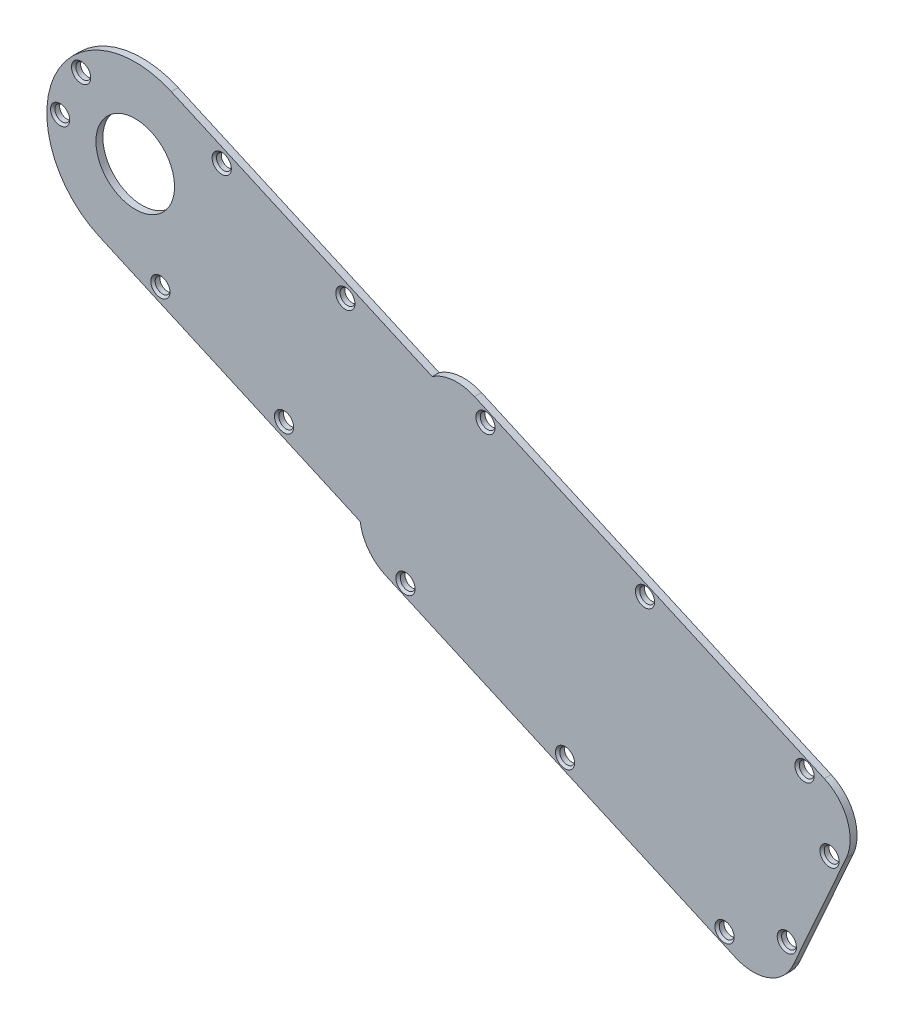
ISO-10303-21;
HEADER;
FILE_DESCRIPTION(('STEP AP214'),'2;1');
FILE_NAME('part.step','',(''),(''),'','','');
FILE_SCHEMA(('AUTOMOTIVE_DESIGN { 1 0 10303 214 1 1 1 1 }'));
ENDSEC;
DATA;
#1=APPLICATION_CONTEXT('core data for automotive mechanical design processes');
#2=APPLICATION_PROTOCOL_DEFINITION('international standard','automotive_design',2000,#1);
#3=PRODUCT_CONTEXT('',#1,'mechanical');
#4=PRODUCT('Part','Part','',(#3));
#5=PRODUCT_RELATED_PRODUCT_CATEGORY('part','',(#4));
#6=PRODUCT_DEFINITION_FORMATION('','',#4);
#7=PRODUCT_DEFINITION_CONTEXT('part definition',#1,'design');
#8=PRODUCT_DEFINITION('design','',#6,#7);
#9=PRODUCT_DEFINITION_SHAPE('','',#8);
#10=(LENGTH_UNIT() NAMED_UNIT(*) SI_UNIT(.MILLI.,.METRE.));
#11=(NAMED_UNIT(*) PLANE_ANGLE_UNIT() SI_UNIT($,.RADIAN.));
#12=(NAMED_UNIT(*) SI_UNIT($,.STERADIAN.) SOLID_ANGLE_UNIT());
#13=UNCERTAINTY_MEASURE_WITH_UNIT(LENGTH_MEASURE(1.E-05),#10,'distance_accuracy_value','');
#14=(GEOMETRIC_REPRESENTATION_CONTEXT(3) GLOBAL_UNCERTAINTY_ASSIGNED_CONTEXT((#13)) GLOBAL_UNIT_ASSIGNED_CONTEXT((#10,
#11,#12)) REPRESENTATION_CONTEXT('',''));
#15=CARTESIAN_POINT('',(0.,0.,0.));
#16=DIRECTION('',(0.,0.,1.));
#17=DIRECTION('',(1.,0.,0.));
#18=AXIS2_PLACEMENT_3D('',#15,#16,#17);
#19=CARTESIAN_POINT('',(-118.301730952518,58.7252307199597,0.));
#20=DIRECTION('',(0.,0.,1.));
#21=DIRECTION('',(1.,0.,0.));
#22=AXIS2_PLACEMENT_3D('',#19,#20,#21);
#23=CYLINDRICAL_SURFACE('',#22,9.99999999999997);
#24=CARTESIAN_POINT('',(-118.301730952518,58.7252307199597,1.5875));
#25=DIRECTION('',(0.,0.,1.));
#26=DIRECTION('',(1.,0.,0.));
#27=AXIS2_PLACEMENT_3D('',#24,#25,#26);
#28=CIRCLE('',#27,9.99999999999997);
#29=CARTESIAN_POINT('',(-128.21291008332,57.3953704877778,1.5875));
#30=VERTEX_POINT('',#29);
#31=CARTESIAN_POINT('',(-122.373252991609,49.5916274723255,1.5875));
#32=VERTEX_POINT('',#31);
#33=EDGE_CURVE('E156',#30,#32,#28,.T.);
#34=ORIENTED_EDGE('',*,*,#33,.F.);
#35=DIRECTION('',(0.,0.,1.));
#36=VECTOR('',#35,1.);
#37=CARTESIAN_POINT('',(-128.21291008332,57.3953704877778,0.));
#38=LINE('',#37,#36);
#39=CARTESIAN_POINT('',(-128.21291008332,57.3953704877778,0.));
#40=VERTEX_POINT('',#39);
#41=EDGE_CURVE('E132',#40,#30,#38,.T.);
#42=ORIENTED_EDGE('',*,*,#41,.F.);
#43=CARTESIAN_POINT('',(-118.301730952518,58.7252307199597,0.));
#44=DIRECTION('',(0.,0.,1.));
#45=DIRECTION('',(1.,0.,0.));
#46=AXIS2_PLACEMENT_3D('',#43,#44,#45);
#47=CIRCLE('',#46,9.99999999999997);
#48=CARTESIAN_POINT('',(-122.373252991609,49.5916274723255,0.));
#49=VERTEX_POINT('',#48);
#50=EDGE_CURVE('E128',#40,#49,#47,.T.);
#51=ORIENTED_EDGE('',*,*,#50,.T.);
#52=DIRECTION('',(0.,0.,1.));
#53=VECTOR('',#52,1.);
#54=CARTESIAN_POINT('',(-122.373252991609,49.5916274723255,0.));
#55=LINE('',#54,#53);
#56=EDGE_CURVE('E112',#49,#32,#55,.T.);
#57=ORIENTED_EDGE('',*,*,#56,.T.);
#58=EDGE_LOOP('',(#34,#42,#51,#57));
#59=FACE_BOUND('',#58,.T.);
#60=ADVANCED_FACE('F33',(#59),#23,.T.);
#61=CARTESIAN_POINT('',(-187.987665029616,84.0413967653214,0.));
#62=DIRECTION('',(-0.407152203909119,-0.913360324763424,0.));
#63=DIRECTION('',(0.913360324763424,-0.407152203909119,0.));
#64=AXIS2_PLACEMENT_3D('',#61,#62,#63);
#65=PLANE('',#64);
#66=DIRECTION('',(0.913360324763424,-0.407152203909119,0.));
#67=VECTOR('',#66,1.);
#68=CARTESIAN_POINT('',(-187.987665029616,84.0413967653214,1.5875));
#69=LINE('',#68,#67);
#70=CARTESIAN_POINT('',(-187.987665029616,84.0413967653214,1.5875));
#71=VERTEX_POINT('',#70);
#72=EDGE_CURVE('E133',#71,#30,#69,.T.);
#73=ORIENTED_EDGE('',*,*,#72,.F.);
#74=DIRECTION('',(0.,0.,1.));
#75=VECTOR('',#74,1.);
#76=CARTESIAN_POINT('',(-187.987665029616,84.0413967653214,0.));
#77=LINE('',#76,#75);
#78=CARTESIAN_POINT('',(-187.987665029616,84.0413967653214,0.));
#79=VERTEX_POINT('',#78);
#80=EDGE_CURVE('E174',#79,#71,#77,.T.);
#81=ORIENTED_EDGE('',*,*,#80,.F.);
#82=DIRECTION('',(0.913360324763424,-0.407152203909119,0.));
#83=VECTOR('',#82,1.);
#84=CARTESIAN_POINT('',(-187.987665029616,84.0413967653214,0.));
#85=LINE('',#84,#83);
#86=EDGE_CURVE('E123',#79,#40,#85,.T.);
#87=ORIENTED_EDGE('',*,*,#86,.T.);
#88=ORIENTED_EDGE('',*,*,#41,.T.);
#89=EDGE_LOOP('',(#73,#81,#87,#88));
#90=FACE_BOUND('',#89,.T.);
#91=ADVANCED_FACE('F301',(#90),#65,.T.);
#92=CARTESIAN_POINT('',(-179.742832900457,102.536943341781,0.));
#93=DIRECTION('',(0.,0.,1.));
#94=DIRECTION('',(1.,0.,0.));
#95=AXIS2_PLACEMENT_3D('',#92,#93,#94);
#96=CYLINDRICAL_SURFACE('',#95,20.2500000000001);
#97=CARTESIAN_POINT('',(-179.742832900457,102.536943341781,1.5875));
#98=DIRECTION('',(0.,0.,1.));
#99=DIRECTION('',(1.,0.,0.));
#100=AXIS2_PLACEMENT_3D('',#97,#98,#99);
#101=CIRCLE('',#100,20.2500000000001);
#102=CARTESIAN_POINT('',(-171.498000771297,121.03248991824,1.5875));
#103=VERTEX_POINT('',#102);
#104=EDGE_CURVE('E136',#103,#71,#101,.T.);
#105=ORIENTED_EDGE('',*,*,#104,.F.);
#106=DIRECTION('',(0.,0.,1.));
#107=VECTOR('',#106,1.);
#108=CARTESIAN_POINT('',(-171.498000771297,121.03248991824,0.));
#109=LINE('',#108,#107);
#110=CARTESIAN_POINT('',(-171.498000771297,121.03248991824,0.));
#111=VERTEX_POINT('',#110);
#112=EDGE_CURVE('E176',#111,#103,#109,.T.);
#113=ORIENTED_EDGE('',*,*,#112,.F.);
#114=CARTESIAN_POINT('',(-179.742832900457,102.536943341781,0.));
#115=DIRECTION('',(0.,0.,1.));
#116=DIRECTION('',(1.,0.,0.));
#117=AXIS2_PLACEMENT_3D('',#114,#115,#116);
#118=CIRCLE('',#117,20.2500000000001);
#119=EDGE_CURVE('E152',#111,#79,#118,.T.);
#120=ORIENTED_EDGE('',*,*,#119,.T.);
#121=ORIENTED_EDGE('',*,*,#80,.T.);
#122=EDGE_LOOP('',(#105,#113,#120,#121));
#123=FACE_BOUND('',#122,.T.);
#124=ADVANCED_FACE('F299',(#123),#96,.T.);
#125=CARTESIAN_POINT('',(-111.723245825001,94.3864636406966,0.));
#126=DIRECTION('',(0.407152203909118,0.913360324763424,0.));
#127=DIRECTION('',(-0.913360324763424,0.407152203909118,0.));
#128=AXIS2_PLACEMENT_3D('',#125,#126,#127);
#129=PLANE('',#128);
#130=DIRECTION('',(-0.913360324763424,0.407152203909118,0.));
#131=VECTOR('',#130,1.);
#132=CARTESIAN_POINT('',(-111.723245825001,94.3864636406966,1.5875));
#133=LINE('',#132,#131);
#134=CARTESIAN_POINT('',(-111.723245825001,94.3864636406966,1.5875));
#135=VERTEX_POINT('',#134);
#136=EDGE_CURVE('E167',#135,#103,#133,.T.);
#137=ORIENTED_EDGE('',*,*,#136,.F.);
#138=DIRECTION('',(0.,0.,1.));
#139=VECTOR('',#138,1.);
#140=CARTESIAN_POINT('',(-111.723245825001,94.3864636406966,0.));
#141=LINE('',#140,#139);
#142=CARTESIAN_POINT('',(-111.723245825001,94.3864636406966,0.));
#143=VERTEX_POINT('',#142);
#144=EDGE_CURVE('E178',#143,#135,#141,.T.);
#145=ORIENTED_EDGE('',*,*,#144,.F.);
#146=DIRECTION('',(-0.913360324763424,0.407152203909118,0.));
#147=VECTOR('',#146,1.);
#148=CARTESIAN_POINT('',(-111.723245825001,94.3864636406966,0.));
#149=LINE('',#148,#147);
#150=EDGE_CURVE('E149',#143,#111,#149,.T.);
#151=ORIENTED_EDGE('',*,*,#150,.T.);
#152=ORIENTED_EDGE('',*,*,#112,.T.);
#153=EDGE_LOOP('',(#137,#145,#151,#152));
#154=FACE_BOUND('',#153,.T.);
#155=ADVANCED_FACE('F295',(#154),#129,.T.);
#156=CARTESIAN_POINT('',(-106.087164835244,86.1260404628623,0.));
#157=DIRECTION('',(0.,0.,1.));
#158=DIRECTION('',(1.,0.,0.));
#159=AXIS2_PLACEMENT_3D('',#156,#157,#158);
#160=CYLINDRICAL_SURFACE('',#159,10.0000000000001);
#161=CARTESIAN_POINT('',(-106.087164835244,86.1260404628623,1.5875));
#162=DIRECTION('',(0.,0.,1.));
#163=DIRECTION('',(1.,0.,0.));
#164=AXIS2_PLACEMENT_3D('',#161,#162,#163);
#165=CIRCLE('',#164,10.0000000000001);
#166=CARTESIAN_POINT('',(-102.015642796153,95.2596437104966,1.5875));
#167=VERTEX_POINT('',#166);
#168=EDGE_CURVE('E164',#167,#135,#165,.T.);
#169=ORIENTED_EDGE('',*,*,#168,.F.);
#170=DIRECTION('',(0.,0.,1.));
#171=VECTOR('',#170,1.);
#172=CARTESIAN_POINT('',(-102.015642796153,95.2596437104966,0.));
#173=LINE('',#172,#171);
#174=CARTESIAN_POINT('',(-102.015642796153,95.2596437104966,0.));
#175=VERTEX_POINT('',#174);
#176=EDGE_CURVE('E122',#175,#167,#173,.T.);
#177=ORIENTED_EDGE('',*,*,#176,.F.);
#178=CARTESIAN_POINT('',(-106.087164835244,86.1260404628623,0.));
#179=DIRECTION('',(0.,0.,1.));
#180=DIRECTION('',(1.,0.,0.));
#181=AXIS2_PLACEMENT_3D('',#178,#179,#180);
#182=CIRCLE('',#181,10.0000000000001);
#183=EDGE_CURVE('E146',#175,#143,#182,.T.);
#184=ORIENTED_EDGE('',*,*,#183,.T.);
#185=ORIENTED_EDGE('',*,*,#144,.T.);
#186=EDGE_LOOP('',(#169,#177,#184,#185));
#187=FACE_BOUND('',#186,.T.);
#188=ADVANCED_FACE('F290',(#187),#160,.T.);
#189=CARTESIAN_POINT('',(-12.7803390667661,55.4808733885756,0.));
#190=DIRECTION('',(0.407152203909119,0.913360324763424,0.));
#191=DIRECTION('',(-0.913360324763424,0.407152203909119,0.));
#192=AXIS2_PLACEMENT_3D('',#189,#190,#191);
#193=PLANE('',#192);
#194=DIRECTION('',(-0.913360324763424,0.407152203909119,0.));
#195=VECTOR('',#194,1.);
#196=CARTESIAN_POINT('',(-12.7803390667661,55.4808733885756,1.5875));
#197=LINE('',#196,#195);
#198=CARTESIAN_POINT('',(-21.9139423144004,59.5523954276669,1.5875));
#199=VERTEX_POINT('',#198);
#200=EDGE_CURVE('E162',#199,#167,#197,.T.);
#201=ORIENTED_EDGE('',*,*,#200,.F.);
#202=DIRECTION('',(0.,0.,1.));
#203=VECTOR('',#202,1.);
#204=CARTESIAN_POINT('',(-21.9139423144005,59.5523954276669,0.));
#205=LINE('',#204,#203);
#206=CARTESIAN_POINT('',(-21.9139423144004,59.5523954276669,0.));
#207=VERTEX_POINT('',#206);
#208=EDGE_CURVE('E56',#199,#207,#205,.F.);
#209=ORIENTED_EDGE('',*,*,#208,.T.);
#210=DIRECTION('',(-0.913360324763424,0.407152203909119,0.));
#211=VECTOR('',#210,1.);
#212=CARTESIAN_POINT('',(-12.7803390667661,55.4808733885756,0.));
#213=LINE('',#212,#211);
#214=EDGE_CURVE('E144',#207,#175,#213,.T.);
#215=ORIENTED_EDGE('',*,*,#214,.T.);
#216=ORIENTED_EDGE('',*,*,#176,.T.);
#217=EDGE_LOOP('',(#201,#209,#215,#216));
#218=FACE_BOUND('',#217,.T.);
#219=ADVANCED_FACE('F286',(#218),#193,.T.);
#220=CARTESIAN_POINT('',(-33.137949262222,9.8128571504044,0.));
#221=DIRECTION('',(0.913360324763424,-0.407152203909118,0.));
#222=DIRECTION('',(0.407152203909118,0.913360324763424,0.));
#223=AXIS2_PLACEMENT_3D('',#220,#221,#222);
#224=PLANE('',#223);
#225=DIRECTION('',(0.407152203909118,0.913360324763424,0.));
#226=VECTOR('',#225,1.);
#227=CARTESIAN_POINT('',(-33.137949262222,9.8128571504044,0.));
#228=LINE('',#227,#226);
#229=CARTESIAN_POINT('',(-29.0664272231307,18.9464603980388,0.));
#230=VERTEX_POINT('',#229);
#231=CARTESIAN_POINT('',(-16.8518611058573,46.3472701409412,0.));
#232=VERTEX_POINT('',#231);
#233=EDGE_CURVE('E130',#230,#232,#228,.T.);
#234=ORIENTED_EDGE('',*,*,#233,.T.);
#235=DIRECTION('',(0.,0.,1.));
#236=VECTOR('',#235,1.);
#237=CARTESIAN_POINT('',(-16.8518611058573,46.3472701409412,0.));
#238=LINE('',#237,#236);
#239=CARTESIAN_POINT('',(-16.8518611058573,46.3472701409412,1.5875));
#240=VERTEX_POINT('',#239);
#241=EDGE_CURVE('E267',#232,#240,#238,.T.);
#242=ORIENTED_EDGE('',*,*,#241,.T.);
#243=DIRECTION('',(0.407152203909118,0.913360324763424,0.));
#244=VECTOR('',#243,1.);
#245=CARTESIAN_POINT('',(-33.137949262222,9.8128571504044,1.5875));
#246=LINE('',#245,#244);
#247=CARTESIAN_POINT('',(-29.0664272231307,18.9464603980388,1.5875));
#248=VERTEX_POINT('',#247);
#249=EDGE_CURVE('E159',#248,#240,#246,.T.);
#250=ORIENTED_EDGE('',*,*,#249,.F.);
#251=DIRECTION('',(0.,0.,1.));
#252=VECTOR('',#251,1.);
#253=CARTESIAN_POINT('',(-29.0664272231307,18.9464603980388,0.));
#254=LINE('',#253,#252);
#255=EDGE_CURVE('E265',#248,#230,#254,.F.);
#256=ORIENTED_EDGE('',*,*,#255,.T.);
#257=EDGE_LOOP('',(#234,#242,#250,#256));
#258=FACE_BOUND('',#257,.T.);
#259=ADVANCED_FACE('F280',(#258),#224,.T.);
#260=CARTESIAN_POINT('',(-122.373252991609,49.5916274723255,0.));
#261=DIRECTION('',(-0.407152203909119,-0.913360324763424,0.));
#262=DIRECTION('',(0.913360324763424,-0.40715220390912,0.));
#263=AXIS2_PLACEMENT_3D('',#260,#261,#262);
#264=PLANE('',#263);
#265=DIRECTION('',(0.913360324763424,-0.407152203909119,0.));
#266=VECTOR('',#265,1.);
#267=CARTESIAN_POINT('',(-122.373252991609,49.5916274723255,0.));
#268=LINE('',#267,#266);
#269=CARTESIAN_POINT('',(-42.2715525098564,13.8843791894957,0.));
#270=VERTEX_POINT('',#269);
#271=EDGE_CURVE('E114',#49,#270,#268,.T.);
#272=ORIENTED_EDGE('',*,*,#271,.T.);
#273=DIRECTION('',(0.,0.,1.));
#274=VECTOR('',#273,1.);
#275=CARTESIAN_POINT('',(-42.2715525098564,13.8843791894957,0.));
#276=LINE('',#275,#274);
#277=CARTESIAN_POINT('',(-42.2715525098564,13.8843791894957,1.5875));
#278=VERTEX_POINT('',#277);
#279=EDGE_CURVE('E11',#270,#278,#276,.T.);
#280=ORIENTED_EDGE('',*,*,#279,.T.);
#281=DIRECTION('',(0.913360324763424,-0.407152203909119,0.));
#282=VECTOR('',#281,1.);
#283=CARTESIAN_POINT('',(-122.373252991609,49.5916274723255,1.5875));
#284=LINE('',#283,#282);
#285=EDGE_CURVE('E117',#32,#278,#284,.T.);
#286=ORIENTED_EDGE('',*,*,#285,.F.);
#287=ORIENTED_EDGE('',*,*,#56,.F.);
#288=EDGE_LOOP('',(#272,#280,#286,#287));
#289=FACE_BOUND('',#288,.T.);
#290=ADVANCED_FACE('F113',(#289),#264,.T.);
#291=CARTESIAN_POINT('',(-118.301730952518,58.7252307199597,0.));
#292=DIRECTION('',(0.,0.,1.));
#293=DIRECTION('',(1.,0.,0.));
#294=AXIS2_PLACEMENT_3D('',#291,#292,#293);
#295=PLANE('',#294);
#296=CARTESIAN_POINT('',(-179.742832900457,102.536943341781,0.));
#297=DIRECTION('',(0.,0.,-1.));
#298=DIRECTION('',(-1.,0.,0.));
#299=AXIS2_PLACEMENT_3D('',#296,#297,#298);
#300=CIRCLE('',#299,9.00000000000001);
#301=CARTESIAN_POINT('',(-188.742832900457,102.536943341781,0.));
#302=VERTEX_POINT('',#301);
#303=EDGE_CURVE('E727',#302,#302,#300,.T.);
#304=ORIENTED_EDGE('',*,*,#303,.F.);
#305=EDGE_LOOP('',(#304));
#306=FACE_BOUND('',#305,.T.);
#307=CARTESIAN_POINT('',(-99.5170860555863,91.4087069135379,0.));
#308=DIRECTION('',(0.,0.,1.));
#309=DIRECTION('',(1.,0.,0.));
#310=AXIS2_PLACEMENT_3D('',#307,#308,#309);
#311=CIRCLE('',#310,1.70000000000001);
#312=CARTESIAN_POINT('',(-97.8170860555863,91.4087069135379,0.));
#313=VERTEX_POINT('',#312);
#314=EDGE_CURVE('E721',#313,#313,#311,.T.);
#315=ORIENTED_EDGE('',*,*,#314,.T.);
#316=EDGE_LOOP('',(#315));
#317=FACE_BOUND('',#316,.T.);
#318=CARTESIAN_POINT('',(-62.9826730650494,75.1226187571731,0.));
#319=DIRECTION('',(0.,0.,1.));
#320=DIRECTION('',(1.,0.,0.));
#321=AXIS2_PLACEMENT_3D('',#318,#319,#320);
#322=CIRCLE('',#321,1.70000000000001);
#323=CARTESIAN_POINT('',(-61.2826730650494,75.1226187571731,0.));
#324=VERTEX_POINT('',#323);
#325=EDGE_CURVE('E718',#324,#324,#322,.T.);
#326=ORIENTED_EDGE('',*,*,#325,.T.);
#327=EDGE_LOOP('',(#326));
#328=FACE_BOUND('',#327,.T.);
#329=CARTESIAN_POINT('',(-26.4482600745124,58.8365306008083,0.));
#330=DIRECTION('',(0.,0.,1.));
#331=DIRECTION('',(1.,0.,0.));
#332=AXIS2_PLACEMENT_3D('',#329,#330,#331);
#333=CIRCLE('',#332,1.70000000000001);
#334=CARTESIAN_POINT('',(-24.7482600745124,58.8365306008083,0.));
#335=VERTEX_POINT('',#334);
#336=EDGE_CURVE('E715',#335,#335,#333,.T.);
#337=ORIENTED_EDGE('',*,*,#336,.T.);
#338=EDGE_LOOP('',(#337));
#339=FACE_BOUND('',#338,.T.);
#340=CARTESIAN_POINT('',(-20.7220626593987,44.7879305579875,0.));
#341=DIRECTION('',(0.,0.,1.));
#342=DIRECTION('',(1.,0.,0.));
#343=AXIS2_PLACEMENT_3D('',#340,#341,#342);
#344=CIRCLE('',#343,1.70000000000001);
#345=CARTESIAN_POINT('',(-19.0220626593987,44.7879305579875,0.));
#346=VERTEX_POINT('',#345);
#347=EDGE_CURVE('E712',#346,#346,#344,.T.);
#348=ORIENTED_EDGE('',*,*,#347,.T.);
#349=EDGE_LOOP('',(#348));
#350=FACE_BOUND('',#349,.T.);
#351=CARTESIAN_POINT('',(-30.4937155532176,22.8672827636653,0.));
#352=DIRECTION('',(0.,0.,1.));
#353=DIRECTION('',(1.,0.,0.));
#354=AXIS2_PLACEMENT_3D('',#351,#352,#353);
#355=CIRCLE('',#354,1.70000000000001);
#356=CARTESIAN_POINT('',(-28.7937155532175,22.8672827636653,0.));
#357=VERTEX_POINT('',#356);
#358=EDGE_CURVE('E707',#357,#357,#355,.T.);
#359=ORIENTED_EDGE('',*,*,#358,.T.);
#360=EDGE_LOOP('',(#359));
#361=FACE_BOUND('',#360,.T.);
#362=CARTESIAN_POINT('',(-44.7701092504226,17.7353159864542,0.));
#363=DIRECTION('',(0.,0.,1.));
#364=DIRECTION('',(1.,0.,0.));
#365=AXIS2_PLACEMENT_3D('',#362,#363,#364);
#366=CIRCLE('',#365,1.70000000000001);
#367=CARTESIAN_POINT('',(-43.0701092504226,17.7353159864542,0.));
#368=VERTEX_POINT('',#367);
#369=EDGE_CURVE('E705',#368,#368,#366,.T.);
#370=ORIENTED_EDGE('',*,*,#369,.T.);
#371=EDGE_LOOP('',(#370));
#372=FACE_BOUND('',#371,.T.);
#373=CARTESIAN_POINT('',(-81.3045222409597,34.0214041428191,0.));
#374=DIRECTION('',(0.,0.,1.));
#375=DIRECTION('',(1.,0.,0.));
#376=AXIS2_PLACEMENT_3D('',#373,#374,#375);
#377=CIRCLE('',#376,1.70000000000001);
#378=CARTESIAN_POINT('',(-79.6045222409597,34.0214041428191,0.));
#379=VERTEX_POINT('',#378);
#380=EDGE_CURVE('E395',#379,#379,#377,.T.);
#381=ORIENTED_EDGE('',*,*,#380,.T.);
#382=EDGE_LOOP('',(#381));
#383=FACE_BOUND('',#382,.T.);
#384=CARTESIAN_POINT('',(-117.838935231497,50.3074922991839,0.));
#385=DIRECTION('',(0.,0.,1.));
#386=DIRECTION('',(1.,0.,0.));
#387=AXIS2_PLACEMENT_3D('',#384,#385,#386);
#388=CIRCLE('',#387,1.70000000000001);
#389=CARTESIAN_POINT('',(-116.138935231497,50.3074922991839,0.));
#390=VERTEX_POINT('',#389);
#391=EDGE_CURVE('E389',#390,#390,#388,.T.);
#392=ORIENTED_EDGE('',*,*,#391,.T.);
#393=EDGE_LOOP('',(#392));
#394=FACE_BOUND('',#393,.T.);
#395=CARTESIAN_POINT('',(-131.61824276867,99.9705597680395,0.));
#396=DIRECTION('',(0.,0.,1.));
#397=DIRECTION('',(1.,0.,0.));
#398=AXIS2_PLACEMENT_3D('',#395,#396,#397);
#399=CIRCLE('',#398,1.70000000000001);
#400=CARTESIAN_POINT('',(-129.91824276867,99.9705597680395,0.));
#401=VERTEX_POINT('',#400);
#402=EDGE_CURVE('E386',#401,#401,#399,.T.);
#403=ORIENTED_EDGE('',*,*,#402,.T.);
#404=EDGE_LOOP('',(#403));
#405=FACE_BOUND('',#404,.T.);
#406=CARTESIAN_POINT('',(-145.664993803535,68.4596285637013,0.));
#407=DIRECTION('',(0.,0.,1.));
#408=DIRECTION('',(1.,0.,0.));
#409=AXIS2_PLACEMENT_3D('',#406,#407,#408);
#410=CIRCLE('',#409,1.70000000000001);
#411=CARTESIAN_POINT('',(-143.964993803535,68.4596285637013,0.));
#412=VERTEX_POINT('',#411);
#413=EDGE_CURVE('E388',#412,#412,#410,.T.);
#414=ORIENTED_EDGE('',*,*,#413,.T.);
#415=EDGE_LOOP('',(#414));
#416=FACE_BOUND('',#415,.T.);
#417=CARTESIAN_POINT('',(-173.979163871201,81.081346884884,0.));
#418=DIRECTION('',(0.,0.,1.));
#419=DIRECTION('',(1.,0.,0.));
#420=AXIS2_PLACEMENT_3D('',#417,#418,#419);
#421=CIRCLE('',#420,1.70000000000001);
#422=CARTESIAN_POINT('',(-172.279163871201,81.081346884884,0.));
#423=VERTEX_POINT('',#422);
#424=EDGE_CURVE('E392',#423,#423,#421,.T.);
#425=ORIENTED_EDGE('',*,*,#424,.T.);
#426=EDGE_LOOP('',(#425));
#427=FACE_BOUND('',#426,.T.);
#428=CARTESIAN_POINT('',(-159.932412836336,112.592278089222,0.));
#429=DIRECTION('',(0.,0.,1.));
#430=DIRECTION('',(1.,0.,0.));
#431=AXIS2_PLACEMENT_3D('',#428,#429,#430);
#432=CIRCLE('',#431,1.70000000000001);
#433=CARTESIAN_POINT('',(-158.232412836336,112.592278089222,0.));
#434=VERTEX_POINT('',#433);
#435=EDGE_CURVE('E401',#434,#434,#432,.T.);
#436=ORIENTED_EDGE('',*,*,#435,.T.);
#437=EDGE_LOOP('',(#436));
#438=FACE_BOUND('',#437,.T.);
#439=CARTESIAN_POINT('',(-192.145991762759,114.525444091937,0.));
#440=DIRECTION('',(0.,0.,1.));
#441=DIRECTION('',(1.,0.,0.));
#442=AXIS2_PLACEMENT_3D('',#439,#440,#441);
#443=CIRCLE('',#442,1.70000000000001);
#444=CARTESIAN_POINT('',(-190.445991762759,114.525444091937,0.));
#445=VERTEX_POINT('',#444);
#446=EDGE_CURVE('E403',#445,#445,#443,.T.);
#447=ORIENTED_EDGE('',*,*,#446,.T.);
#448=EDGE_LOOP('',(#447));
#449=FACE_BOUND('',#448,.T.);
#450=CARTESIAN_POINT('',(-196.950263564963,103.748070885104,0.));
#451=DIRECTION('',(0.,0.,1.));
#452=DIRECTION('',(1.,0.,0.));
#453=AXIS2_PLACEMENT_3D('',#450,#451,#452);
#454=CIRCLE('',#453,1.70000000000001);
#455=CARTESIAN_POINT('',(-195.250263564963,103.748070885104,0.));
#456=VERTEX_POINT('',#455);
#457=EDGE_CURVE('E139',#456,#456,#454,.T.);
#458=ORIENTED_EDGE('',*,*,#457,.T.);
#459=EDGE_LOOP('',(#458));
#460=FACE_BOUND('',#459,.T.);
#461=ORIENTED_EDGE('',*,*,#214,.F.);
#462=CARTESIAN_POINT('',(-25.9854643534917,50.4187921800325,0.));
#463=DIRECTION('',(0.,0.,1.));
#464=DIRECTION('',(1.,0.,0.));
#465=AXIS2_PLACEMENT_3D('',#462,#463,#464);
#466=CIRCLE('',#465,10.0000000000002);
#467=EDGE_CURVE('E41',#207,#232,#466,.F.);
#468=ORIENTED_EDGE('',*,*,#467,.T.);
#469=ORIENTED_EDGE('',*,*,#233,.F.);
#470=CARTESIAN_POINT('',(-38.2000304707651,23.0179824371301,0.));
#471=DIRECTION('',(0.,0.,1.));
#472=DIRECTION('',(1.,0.,0.));
#473=AXIS2_PLACEMENT_3D('',#470,#471,#472);
#474=CIRCLE('',#473,10.0000000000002);
#475=EDGE_CURVE('E48',#230,#270,#474,.F.);
#476=ORIENTED_EDGE('',*,*,#475,.T.);
#477=ORIENTED_EDGE('',*,*,#271,.F.);
#478=ORIENTED_EDGE('',*,*,#50,.F.);
#479=ORIENTED_EDGE('',*,*,#86,.F.);
#480=ORIENTED_EDGE('',*,*,#119,.F.);
#481=ORIENTED_EDGE('',*,*,#150,.F.);
#482=ORIENTED_EDGE('',*,*,#183,.F.);
#483=EDGE_LOOP('',(#461,#468,#469,#476,#477,#478,#479,#480,#481,#482));
#484=FACE_BOUND('',#483,.T.);
#485=ADVANCED_FACE('F126',(#306,#317,#328,#339,#350,#361,#372,#383,#394,#405,#416,#427,#438,
#449,#460,#484),#295,.F.);
#486=CARTESIAN_POINT('',(-118.301730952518,58.7252307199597,1.5875));
#487=DIRECTION('',(0.,0.,1.));
#488=DIRECTION('',(1.,0.,0.));
#489=AXIS2_PLACEMENT_3D('',#486,#487,#488);
#490=PLANE('',#489);
#491=CARTESIAN_POINT('',(-159.932412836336,112.592278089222,1.5875));
#492=DIRECTION('',(0.,0.,1.));
#493=DIRECTION('',(1.,0.,0.));
#494=AXIS2_PLACEMENT_3D('',#491,#492,#493);
#495=CIRCLE('',#494,2.1999999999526);
#496=CARTESIAN_POINT('',(-157.732412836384,112.592278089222,1.5875));
#497=VERTEX_POINT('',#496);
#498=EDGE_CURVE('E223',#497,#497,#495,.F.);
#499=ORIENTED_EDGE('',*,*,#498,.T.);
#500=EDGE_LOOP('',(#499));
#501=FACE_BOUND('',#500,.T.);
#502=CARTESIAN_POINT('',(-30.4937155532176,22.8672827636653,1.5875));
#503=DIRECTION('',(0.,0.,1.));
#504=DIRECTION('',(1.,0.,0.));
#505=AXIS2_PLACEMENT_3D('',#502,#503,#504);
#506=CIRCLE('',#505,2.1999999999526);
#507=CARTESIAN_POINT('',(-28.293715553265,22.8672827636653,1.5875));
#508=VERTEX_POINT('',#507);
#509=EDGE_CURVE('E220',#508,#508,#506,.F.);
#510=ORIENTED_EDGE('',*,*,#509,.T.);
#511=EDGE_LOOP('',(#510));
#512=FACE_BOUND('',#511,.T.);
#513=CARTESIAN_POINT('',(-196.950263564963,103.748070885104,1.5875));
#514=DIRECTION('',(0.,0.,1.));
#515=DIRECTION('',(1.,0.,0.));
#516=AXIS2_PLACEMENT_3D('',#513,#514,#515);
#517=CIRCLE('',#516,2.19999999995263);
#518=CARTESIAN_POINT('',(-194.750263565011,103.748070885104,1.5875));
#519=VERTEX_POINT('',#518);
#520=EDGE_CURVE('E217',#519,#519,#517,.F.);
#521=ORIENTED_EDGE('',*,*,#520,.T.);
#522=EDGE_LOOP('',(#521));
#523=FACE_BOUND('',#522,.T.);
#524=CARTESIAN_POINT('',(-44.7701092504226,17.7353159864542,1.5875));
#525=DIRECTION('',(0.,0.,1.));
#526=DIRECTION('',(1.,0.,0.));
#527=AXIS2_PLACEMENT_3D('',#524,#525,#526);
#528=CIRCLE('',#527,2.1999999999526);
#529=CARTESIAN_POINT('',(-42.57010925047,17.7353159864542,1.5875));
#530=VERTEX_POINT('',#529);
#531=EDGE_CURVE('E214',#530,#530,#528,.F.);
#532=ORIENTED_EDGE('',*,*,#531,.T.);
#533=EDGE_LOOP('',(#532));
#534=FACE_BOUND('',#533,.T.);
#535=CARTESIAN_POINT('',(-173.979163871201,81.081346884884,1.5875));
#536=DIRECTION('',(0.,0.,1.));
#537=DIRECTION('',(1.,0.,0.));
#538=AXIS2_PLACEMENT_3D('',#535,#536,#537);
#539=CIRCLE('',#538,2.1999999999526);
#540=CARTESIAN_POINT('',(-171.779163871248,81.081346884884,1.5875));
#541=VERTEX_POINT('',#540);
#542=EDGE_CURVE('E211',#541,#541,#539,.F.);
#543=ORIENTED_EDGE('',*,*,#542,.T.);
#544=EDGE_LOOP('',(#543));
#545=FACE_BOUND('',#544,.T.);
#546=CARTESIAN_POINT('',(-81.3045222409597,34.0214041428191,1.5875));
#547=DIRECTION('',(0.,0.,1.));
#548=DIRECTION('',(1.,0.,0.));
#549=AXIS2_PLACEMENT_3D('',#546,#547,#548);
#550=CIRCLE('',#549,2.1999999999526);
#551=CARTESIAN_POINT('',(-79.1045222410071,34.0214041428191,1.5875));
#552=VERTEX_POINT('',#551);
#553=EDGE_CURVE('E208',#552,#552,#550,.F.);
#554=ORIENTED_EDGE('',*,*,#553,.T.);
#555=EDGE_LOOP('',(#554));
#556=FACE_BOUND('',#555,.T.);
#557=CARTESIAN_POINT('',(-192.145991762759,114.525444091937,1.5875));
#558=DIRECTION('',(0.,0.,1.));
#559=DIRECTION('',(1.,0.,0.));
#560=AXIS2_PLACEMENT_3D('',#557,#558,#559);
#561=CIRCLE('',#560,2.19999999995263);
#562=CARTESIAN_POINT('',(-189.945991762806,114.525444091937,1.5875));
#563=VERTEX_POINT('',#562);
#564=EDGE_CURVE('E205',#563,#563,#561,.F.);
#565=ORIENTED_EDGE('',*,*,#564,.T.);
#566=EDGE_LOOP('',(#565));
#567=FACE_BOUND('',#566,.T.);
#568=CARTESIAN_POINT('',(-62.9826730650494,75.1226187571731,1.5875));
#569=DIRECTION('',(0.,0.,1.));
#570=DIRECTION('',(1.,0.,0.));
#571=AXIS2_PLACEMENT_3D('',#568,#569,#570);
#572=CIRCLE('',#571,2.1999999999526);
#573=CARTESIAN_POINT('',(-60.7826730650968,75.1226187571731,1.5875));
#574=VERTEX_POINT('',#573);
#575=EDGE_CURVE('E202',#574,#574,#572,.F.);
#576=ORIENTED_EDGE('',*,*,#575,.T.);
#577=EDGE_LOOP('',(#576));
#578=FACE_BOUND('',#577,.T.);
#579=CARTESIAN_POINT('',(-20.7220626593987,44.7879305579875,1.5875));
#580=DIRECTION('',(0.,0.,1.));
#581=DIRECTION('',(1.,0.,0.));
#582=AXIS2_PLACEMENT_3D('',#579,#580,#581);
#583=CIRCLE('',#582,2.19999999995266);
#584=CARTESIAN_POINT('',(-18.522062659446,44.7879305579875,1.5875));
#585=VERTEX_POINT('',#584);
#586=EDGE_CURVE('E199',#585,#585,#583,.F.);
#587=ORIENTED_EDGE('',*,*,#586,.T.);
#588=EDGE_LOOP('',(#587));
#589=FACE_BOUND('',#588,.T.);
#590=CARTESIAN_POINT('',(-26.4482600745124,58.8365306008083,1.5875));
#591=DIRECTION('',(0.,0.,1.));
#592=DIRECTION('',(1.,0.,0.));
#593=AXIS2_PLACEMENT_3D('',#590,#591,#592);
#594=CIRCLE('',#593,2.1999999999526);
#595=CARTESIAN_POINT('',(-24.2482600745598,58.8365306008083,1.5875));
#596=VERTEX_POINT('',#595);
#597=EDGE_CURVE('E196',#596,#596,#594,.F.);
#598=ORIENTED_EDGE('',*,*,#597,.T.);
#599=EDGE_LOOP('',(#598));
#600=FACE_BOUND('',#599,.T.);
#601=CARTESIAN_POINT('',(-145.664993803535,68.4596285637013,1.5875));
#602=DIRECTION('',(0.,0.,1.));
#603=DIRECTION('',(1.,0.,0.));
#604=AXIS2_PLACEMENT_3D('',#601,#602,#603);
#605=CIRCLE('',#604,2.19999999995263);
#606=CARTESIAN_POINT('',(-143.464993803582,68.4596285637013,1.5875));
#607=VERTEX_POINT('',#606);
#608=EDGE_CURVE('E193',#607,#607,#605,.F.);
#609=ORIENTED_EDGE('',*,*,#608,.T.);
#610=EDGE_LOOP('',(#609));
#611=FACE_BOUND('',#610,.T.);
#612=CARTESIAN_POINT('',(-117.838935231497,50.3074922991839,1.5875));
#613=DIRECTION('',(0.,0.,1.));
#614=DIRECTION('',(1.,0.,0.));
#615=AXIS2_PLACEMENT_3D('',#612,#613,#614);
#616=CIRCLE('',#615,2.1999999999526);
#617=CARTESIAN_POINT('',(-115.638935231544,50.3074922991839,1.5875));
#618=VERTEX_POINT('',#617);
#619=EDGE_CURVE('E190',#618,#618,#616,.F.);
#620=ORIENTED_EDGE('',*,*,#619,.T.);
#621=EDGE_LOOP('',(#620));
#622=FACE_BOUND('',#621,.T.);
#623=CARTESIAN_POINT('',(-99.5170860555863,91.4087069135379,1.5875));
#624=DIRECTION('',(0.,0.,1.));
#625=DIRECTION('',(1.,0.,0.));
#626=AXIS2_PLACEMENT_3D('',#623,#624,#625);
#627=CIRCLE('',#626,2.1999999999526);
#628=CARTESIAN_POINT('',(-97.3170860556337,91.4087069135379,1.5875));
#629=VERTEX_POINT('',#628);
#630=EDGE_CURVE('E187',#629,#629,#627,.F.);
#631=ORIENTED_EDGE('',*,*,#630,.T.);
#632=EDGE_LOOP('',(#631));
#633=FACE_BOUND('',#632,.T.);
#634=CARTESIAN_POINT('',(-131.61824276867,99.9705597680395,1.5875));
#635=DIRECTION('',(0.,0.,1.));
#636=DIRECTION('',(1.,0.,0.));
#637=AXIS2_PLACEMENT_3D('',#634,#635,#636);
#638=CIRCLE('',#637,2.1999999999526);
#639=CARTESIAN_POINT('',(-129.418242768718,99.9705597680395,1.5875));
#640=VERTEX_POINT('',#639);
#641=EDGE_CURVE('E184',#640,#640,#638,.F.);
#642=ORIENTED_EDGE('',*,*,#641,.T.);
#643=EDGE_LOOP('',(#642));
#644=FACE_BOUND('',#643,.T.);
#645=CARTESIAN_POINT('',(-179.742832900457,102.536943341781,1.58750000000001));
#646=DIRECTION('',(0.,0.,-1.));
#647=DIRECTION('',(-1.,0.,0.));
#648=AXIS2_PLACEMENT_3D('',#645,#646,#647);
#649=CIRCLE('',#648,9.00000000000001);
#650=CARTESIAN_POINT('',(-188.742832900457,102.536943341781,1.58750000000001));
#651=VERTEX_POINT('',#650);
#652=EDGE_CURVE('E724',#651,#651,#649,.T.);
#653=ORIENTED_EDGE('',*,*,#652,.T.);
#654=EDGE_LOOP('',(#653));
#655=FACE_BOUND('',#654,.T.);
#656=ORIENTED_EDGE('',*,*,#249,.T.);
#657=CARTESIAN_POINT('',(-25.9854643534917,50.4187921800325,1.5875));
#658=DIRECTION('',(0.,0.,1.));
#659=DIRECTION('',(1.,0.,0.));
#660=AXIS2_PLACEMENT_3D('',#657,#658,#659);
#661=CIRCLE('',#660,10.0000000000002);
#662=EDGE_CURVE('E272',#240,#199,#661,.T.);
#663=ORIENTED_EDGE('',*,*,#662,.T.);
#664=ORIENTED_EDGE('',*,*,#200,.T.);
#665=ORIENTED_EDGE('',*,*,#168,.T.);
#666=ORIENTED_EDGE('',*,*,#136,.T.);
#667=ORIENTED_EDGE('',*,*,#104,.T.);
#668=ORIENTED_EDGE('',*,*,#72,.T.);
#669=ORIENTED_EDGE('',*,*,#33,.T.);
#670=ORIENTED_EDGE('',*,*,#285,.T.);
#671=CARTESIAN_POINT('',(-38.2000304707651,23.0179824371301,1.5875));
#672=DIRECTION('',(0.,0.,1.));
#673=DIRECTION('',(1.,0.,0.));
#674=AXIS2_PLACEMENT_3D('',#671,#672,#673);
#675=CIRCLE('',#674,10.0000000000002);
#676=EDGE_CURVE('E270',#278,#248,#675,.T.);
#677=ORIENTED_EDGE('',*,*,#676,.T.);
#678=EDGE_LOOP('',(#656,#663,#664,#665,#666,#667,#668,#669,#670,#677));
#679=FACE_BOUND('',#678,.T.);
#680=ADVANCED_FACE('F285',(#501,#512,#523,#534,#545,#556,#567,#578,#589,#600,#611,#622,#633,
#644,#655,#679),#490,.T.);
#681=CARTESIAN_POINT('',(-196.950263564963,103.748070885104,1.5875));
#682=DIRECTION('',(0.,0.,1.));
#683=DIRECTION('',(1.,0.,0.));
#684=AXIS2_PLACEMENT_3D('',#681,#682,#683);
#685=CYLINDRICAL_SURFACE('',#684,1.70000000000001);
#686=CARTESIAN_POINT('',(-196.950263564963,103.748070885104,1.08749999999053));
#687=DIRECTION('',(0.,0.,1.));
#688=DIRECTION('',(1.,0.,0.));
#689=AXIS2_PLACEMENT_3D('',#686,#687,#688);
#690=CIRCLE('',#689,1.70000000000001);
#691=CARTESIAN_POINT('',(-195.250263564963,103.748070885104,1.08749999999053));
#692=VERTEX_POINT('',#691);
#693=EDGE_CURVE('E229',#692,#692,#690,.T.);
#694=ORIENTED_EDGE('',*,*,#693,.T.);
#695=EDGE_LOOP('',(#694));
#696=FACE_BOUND('',#695,.T.);
#697=ORIENTED_EDGE('',*,*,#457,.F.);
#698=EDGE_LOOP('',(#697));
#699=FACE_BOUND('',#698,.T.);
#700=ADVANCED_FACE('F411',(#696,#699),#685,.F.);
#701=CARTESIAN_POINT('',(-192.145991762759,114.525444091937,1.5875));
#702=DIRECTION('',(0.,0.,1.));
#703=DIRECTION('',(1.,0.,0.));
#704=AXIS2_PLACEMENT_3D('',#701,#702,#703);
#705=CYLINDRICAL_SURFACE('',#704,1.70000000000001);
#706=CARTESIAN_POINT('',(-192.145991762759,114.525444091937,1.08749999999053));
#707=DIRECTION('',(0.,0.,1.));
#708=DIRECTION('',(1.,0.,0.));
#709=AXIS2_PLACEMENT_3D('',#706,#707,#708);
#710=CIRCLE('',#709,1.70000000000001);
#711=CARTESIAN_POINT('',(-190.445991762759,114.525444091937,1.08749999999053));
#712=VERTEX_POINT('',#711);
#713=EDGE_CURVE('E241',#712,#712,#710,.T.);
#714=ORIENTED_EDGE('',*,*,#713,.T.);
#715=EDGE_LOOP('',(#714));
#716=FACE_BOUND('',#715,.T.);
#717=ORIENTED_EDGE('',*,*,#446,.F.);
#718=EDGE_LOOP('',(#717));
#719=FACE_BOUND('',#718,.T.);
#720=ADVANCED_FACE('F413',(#716,#719),#705,.F.);
#721=CARTESIAN_POINT('',(-159.932412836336,112.592278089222,1.5875));
#722=DIRECTION('',(0.,0.,1.));
#723=DIRECTION('',(1.,0.,0.));
#724=AXIS2_PLACEMENT_3D('',#721,#722,#723);
#725=CYLINDRICAL_SURFACE('',#724,1.70000000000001);
#726=CARTESIAN_POINT('',(-159.932412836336,112.592278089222,1.08749999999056));
#727=DIRECTION('',(0.,0.,1.));
#728=DIRECTION('',(1.,0.,0.));
#729=AXIS2_PLACEMENT_3D('',#726,#727,#728);
#730=CIRCLE('',#729,1.70000000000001);
#731=CARTESIAN_POINT('',(-158.232412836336,112.592278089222,1.08749999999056));
#732=VERTEX_POINT('',#731);
#733=EDGE_CURVE('E173',#732,#732,#730,.T.);
#734=ORIENTED_EDGE('',*,*,#733,.T.);
#735=EDGE_LOOP('',(#734));
#736=FACE_BOUND('',#735,.T.);
#737=ORIENTED_EDGE('',*,*,#435,.F.);
#738=EDGE_LOOP('',(#737));
#739=FACE_BOUND('',#738,.T.);
#740=ADVANCED_FACE('F420',(#736,#739),#725,.F.);
#741=CARTESIAN_POINT('',(-173.979163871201,81.081346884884,1.5875));
#742=DIRECTION('',(0.,0.,1.));
#743=DIRECTION('',(1.,0.,0.));
#744=AXIS2_PLACEMENT_3D('',#741,#742,#743);
#745=CYLINDRICAL_SURFACE('',#744,1.70000000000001);
#746=CARTESIAN_POINT('',(-173.979163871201,81.081346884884,1.08749999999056));
#747=DIRECTION('',(0.,0.,1.));
#748=DIRECTION('',(1.,0.,0.));
#749=AXIS2_PLACEMENT_3D('',#746,#747,#748);
#750=CIRCLE('',#749,1.70000000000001);
#751=CARTESIAN_POINT('',(-172.279163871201,81.081346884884,1.08749999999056));
#752=VERTEX_POINT('',#751);
#753=EDGE_CURVE('E235',#752,#752,#750,.T.);
#754=ORIENTED_EDGE('',*,*,#753,.T.);
#755=EDGE_LOOP('',(#754));
#756=FACE_BOUND('',#755,.T.);
#757=ORIENTED_EDGE('',*,*,#424,.F.);
#758=EDGE_LOOP('',(#757));
#759=FACE_BOUND('',#758,.T.);
#760=ADVANCED_FACE('F627',(#756,#759),#745,.F.);
#761=CARTESIAN_POINT('',(-145.664993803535,68.4596285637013,1.5875));
#762=DIRECTION('',(0.,0.,1.));
#763=DIRECTION('',(1.,0.,0.));
#764=AXIS2_PLACEMENT_3D('',#761,#762,#763);
#765=CYLINDRICAL_SURFACE('',#764,1.70000000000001);
#766=CARTESIAN_POINT('',(-145.664993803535,68.4596285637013,1.08749999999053));
#767=DIRECTION('',(0.,0.,1.));
#768=DIRECTION('',(1.,0.,0.));
#769=AXIS2_PLACEMENT_3D('',#766,#767,#768);
#770=CIRCLE('',#769,1.70000000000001);
#771=CARTESIAN_POINT('',(-143.964993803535,68.4596285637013,1.08749999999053));
#772=VERTEX_POINT('',#771);
#773=EDGE_CURVE('E253',#772,#772,#770,.T.);
#774=ORIENTED_EDGE('',*,*,#773,.T.);
#775=EDGE_LOOP('',(#774));
#776=FACE_BOUND('',#775,.T.);
#777=ORIENTED_EDGE('',*,*,#413,.F.);
#778=EDGE_LOOP('',(#777));
#779=FACE_BOUND('',#778,.T.);
#780=ADVANCED_FACE('F382',(#776,#779),#765,.F.);
#781=CARTESIAN_POINT('',(-131.61824276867,99.9705597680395,1.5875));
#782=DIRECTION('',(0.,0.,1.));
#783=DIRECTION('',(1.,0.,0.));
#784=AXIS2_PLACEMENT_3D('',#781,#782,#783);
#785=CYLINDRICAL_SURFACE('',#784,1.70000000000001);
#786=CARTESIAN_POINT('',(-131.61824276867,99.9705597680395,1.08749999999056));
#787=DIRECTION('',(0.,0.,1.));
#788=DIRECTION('',(1.,0.,0.));
#789=AXIS2_PLACEMENT_3D('',#786,#787,#788);
#790=CIRCLE('',#789,1.70000000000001);
#791=CARTESIAN_POINT('',(-129.91824276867,99.9705597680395,1.08749999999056));
#792=VERTEX_POINT('',#791);
#793=EDGE_CURVE('E262',#792,#792,#790,.T.);
#794=ORIENTED_EDGE('',*,*,#793,.T.);
#795=EDGE_LOOP('',(#794));
#796=FACE_BOUND('',#795,.T.);
#797=ORIENTED_EDGE('',*,*,#402,.F.);
#798=EDGE_LOOP('',(#797));
#799=FACE_BOUND('',#798,.T.);
#800=ADVANCED_FACE('F378',(#796,#799),#785,.F.);
#801=CARTESIAN_POINT('',(-117.838935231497,50.3074922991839,1.5875));
#802=DIRECTION('',(0.,0.,1.));
#803=DIRECTION('',(1.,0.,0.));
#804=AXIS2_PLACEMENT_3D('',#801,#802,#803);
#805=CYLINDRICAL_SURFACE('',#804,1.70000000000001);
#806=CARTESIAN_POINT('',(-117.838935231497,50.3074922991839,1.08749999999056));
#807=DIRECTION('',(0.,0.,1.));
#808=DIRECTION('',(1.,0.,0.));
#809=AXIS2_PLACEMENT_3D('',#806,#807,#808);
#810=CIRCLE('',#809,1.70000000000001);
#811=CARTESIAN_POINT('',(-116.138935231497,50.3074922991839,1.08749999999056));
#812=VERTEX_POINT('',#811);
#813=EDGE_CURVE('E256',#812,#812,#810,.T.);
#814=ORIENTED_EDGE('',*,*,#813,.T.);
#815=EDGE_LOOP('',(#814));
#816=FACE_BOUND('',#815,.T.);
#817=ORIENTED_EDGE('',*,*,#391,.F.);
#818=EDGE_LOOP('',(#817));
#819=FACE_BOUND('',#818,.T.);
#820=ADVANCED_FACE('F381',(#816,#819),#805,.F.);
#821=CARTESIAN_POINT('',(-81.3045222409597,34.0214041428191,1.5875));
#822=DIRECTION('',(0.,0.,1.));
#823=DIRECTION('',(1.,0.,0.));
#824=AXIS2_PLACEMENT_3D('',#821,#822,#823);
#825=CYLINDRICAL_SURFACE('',#824,1.70000000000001);
#826=CARTESIAN_POINT('',(-81.3045222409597,34.0214041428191,1.08749999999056));
#827=DIRECTION('',(0.,0.,1.));
#828=DIRECTION('',(1.,0.,0.));
#829=AXIS2_PLACEMENT_3D('',#826,#827,#828);
#830=CIRCLE('',#829,1.70000000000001);
#831=CARTESIAN_POINT('',(-79.6045222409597,34.0214041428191,1.08749999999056));
#832=VERTEX_POINT('',#831);
#833=EDGE_CURVE('E238',#832,#832,#830,.T.);
#834=ORIENTED_EDGE('',*,*,#833,.T.);
#835=EDGE_LOOP('',(#834));
#836=FACE_BOUND('',#835,.T.);
#837=ORIENTED_EDGE('',*,*,#380,.F.);
#838=EDGE_LOOP('',(#837));
#839=FACE_BOUND('',#838,.T.);
#840=ADVANCED_FACE('F597',(#836,#839),#825,.F.);
#841=CARTESIAN_POINT('',(-44.7701092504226,17.7353159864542,1.5875));
#842=DIRECTION('',(0.,0.,1.));
#843=DIRECTION('',(1.,0.,0.));
#844=AXIS2_PLACEMENT_3D('',#841,#842,#843);
#845=CYLINDRICAL_SURFACE('',#844,1.70000000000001);
#846=CARTESIAN_POINT('',(-44.7701092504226,17.7353159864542,1.08749999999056));
#847=DIRECTION('',(0.,0.,1.));
#848=DIRECTION('',(1.,0.,0.));
#849=AXIS2_PLACEMENT_3D('',#846,#847,#848);
#850=CIRCLE('',#849,1.70000000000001);
#851=CARTESIAN_POINT('',(-43.0701092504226,17.7353159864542,1.08749999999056));
#852=VERTEX_POINT('',#851);
#853=EDGE_CURVE('E232',#852,#852,#850,.T.);
#854=ORIENTED_EDGE('',*,*,#853,.T.);
#855=EDGE_LOOP('',(#854));
#856=FACE_BOUND('',#855,.T.);
#857=ORIENTED_EDGE('',*,*,#369,.F.);
#858=EDGE_LOOP('',(#857));
#859=FACE_BOUND('',#858,.T.);
#860=ADVANCED_FACE('F588',(#856,#859),#845,.F.);
#861=CARTESIAN_POINT('',(-30.4937155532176,22.8672827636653,1.5875));
#862=DIRECTION('',(0.,0.,1.));
#863=DIRECTION('',(1.,0.,0.));
#864=AXIS2_PLACEMENT_3D('',#861,#862,#863);
#865=CYLINDRICAL_SURFACE('',#864,1.70000000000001);
#866=CARTESIAN_POINT('',(-30.4937155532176,22.8672827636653,1.08749999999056));
#867=DIRECTION('',(0.,0.,1.));
#868=DIRECTION('',(1.,0.,0.));
#869=AXIS2_PLACEMENT_3D('',#866,#867,#868);
#870=CIRCLE('',#869,1.70000000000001);
#871=CARTESIAN_POINT('',(-28.7937155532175,22.8672827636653,1.08749999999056));
#872=VERTEX_POINT('',#871);
#873=EDGE_CURVE('E226',#872,#872,#870,.T.);
#874=ORIENTED_EDGE('',*,*,#873,.T.);
#875=EDGE_LOOP('',(#874));
#876=FACE_BOUND('',#875,.T.);
#877=ORIENTED_EDGE('',*,*,#358,.F.);
#878=EDGE_LOOP('',(#877));
#879=FACE_BOUND('',#878,.T.);
#880=ADVANCED_FACE('F579',(#876,#879),#865,.F.);
#881=CARTESIAN_POINT('',(-20.7220626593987,44.7879305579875,1.5875));
#882=DIRECTION('',(0.,0.,1.));
#883=DIRECTION('',(1.,0.,0.));
#884=AXIS2_PLACEMENT_3D('',#881,#882,#883);
#885=CYLINDRICAL_SURFACE('',#884,1.70000000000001);
#886=CARTESIAN_POINT('',(-20.7220626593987,44.7879305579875,1.0874999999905));
#887=DIRECTION('',(0.,0.,1.));
#888=DIRECTION('',(1.,0.,0.));
#889=AXIS2_PLACEMENT_3D('',#886,#887,#888);
#890=CIRCLE('',#889,1.70000000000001);
#891=CARTESIAN_POINT('',(-19.0220626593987,44.7879305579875,1.0874999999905));
#892=VERTEX_POINT('',#891);
#893=EDGE_CURVE('E247',#892,#892,#890,.T.);
#894=ORIENTED_EDGE('',*,*,#893,.T.);
#895=EDGE_LOOP('',(#894));
#896=FACE_BOUND('',#895,.T.);
#897=ORIENTED_EDGE('',*,*,#347,.F.);
#898=EDGE_LOOP('',(#897));
#899=FACE_BOUND('',#898,.T.);
#900=ADVANCED_FACE('F570',(#896,#899),#885,.F.);
#901=CARTESIAN_POINT('',(-26.4482600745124,58.8365306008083,1.5875));
#902=DIRECTION('',(0.,0.,1.));
#903=DIRECTION('',(1.,0.,0.));
#904=AXIS2_PLACEMENT_3D('',#901,#902,#903);
#905=CYLINDRICAL_SURFACE('',#904,1.70000000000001);
#906=CARTESIAN_POINT('',(-26.4482600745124,58.8365306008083,1.08749999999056));
#907=DIRECTION('',(0.,0.,1.));
#908=DIRECTION('',(1.,0.,0.));
#909=AXIS2_PLACEMENT_3D('',#906,#907,#908);
#910=CIRCLE('',#909,1.70000000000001);
#911=CARTESIAN_POINT('',(-24.7482600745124,58.8365306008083,1.08749999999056));
#912=VERTEX_POINT('',#911);
#913=EDGE_CURVE('E250',#912,#912,#910,.T.);
#914=ORIENTED_EDGE('',*,*,#913,.T.);
#915=EDGE_LOOP('',(#914));
#916=FACE_BOUND('',#915,.T.);
#917=ORIENTED_EDGE('',*,*,#336,.F.);
#918=EDGE_LOOP('',(#917));
#919=FACE_BOUND('',#918,.T.);
#920=ADVANCED_FACE('F561',(#916,#919),#905,.F.);
#921=CARTESIAN_POINT('',(-62.9826730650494,75.1226187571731,1.5875));
#922=DIRECTION('',(0.,0.,1.));
#923=DIRECTION('',(1.,0.,0.));
#924=AXIS2_PLACEMENT_3D('',#921,#922,#923);
#925=CYLINDRICAL_SURFACE('',#924,1.70000000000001);
#926=CARTESIAN_POINT('',(-62.9826730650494,75.1226187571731,1.08749999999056));
#927=DIRECTION('',(0.,0.,1.));
#928=DIRECTION('',(1.,0.,0.));
#929=AXIS2_PLACEMENT_3D('',#926,#927,#928);
#930=CIRCLE('',#929,1.70000000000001);
#931=CARTESIAN_POINT('',(-61.2826730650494,75.1226187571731,1.08749999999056));
#932=VERTEX_POINT('',#931);
#933=EDGE_CURVE('E244',#932,#932,#930,.T.);
#934=ORIENTED_EDGE('',*,*,#933,.T.);
#935=EDGE_LOOP('',(#934));
#936=FACE_BOUND('',#935,.T.);
#937=ORIENTED_EDGE('',*,*,#325,.F.);
#938=EDGE_LOOP('',(#937));
#939=FACE_BOUND('',#938,.T.);
#940=ADVANCED_FACE('F552',(#936,#939),#925,.F.);
#941=CARTESIAN_POINT('',(-99.5170860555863,91.4087069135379,1.5875));
#942=DIRECTION('',(0.,0.,1.));
#943=DIRECTION('',(1.,0.,0.));
#944=AXIS2_PLACEMENT_3D('',#941,#942,#943);
#945=CYLINDRICAL_SURFACE('',#944,1.70000000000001);
#946=CARTESIAN_POINT('',(-99.5170860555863,91.4087069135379,1.08749999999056));
#947=DIRECTION('',(0.,0.,1.));
#948=DIRECTION('',(1.,0.,0.));
#949=AXIS2_PLACEMENT_3D('',#946,#947,#948);
#950=CIRCLE('',#949,1.70000000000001);
#951=CARTESIAN_POINT('',(-97.8170860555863,91.4087069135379,1.08749999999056));
#952=VERTEX_POINT('',#951);
#953=EDGE_CURVE('E259',#952,#952,#950,.T.);
#954=ORIENTED_EDGE('',*,*,#953,.T.);
#955=EDGE_LOOP('',(#954));
#956=FACE_BOUND('',#955,.T.);
#957=ORIENTED_EDGE('',*,*,#314,.F.);
#958=EDGE_LOOP('',(#957));
#959=FACE_BOUND('',#958,.T.);
#960=ADVANCED_FACE('F543',(#956,#959),#945,.F.);
#961=CARTESIAN_POINT('',(-179.742832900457,102.536943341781,0.));
#962=DIRECTION('',(0.,0.,-1.));
#963=DIRECTION('',(-1.,0.,0.));
#964=AXIS2_PLACEMENT_3D('',#961,#962,#963);
#965=CYLINDRICAL_SURFACE('',#964,9.00000000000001);
#966=ORIENTED_EDGE('',*,*,#652,.F.);
#967=EDGE_LOOP('',(#966));
#968=FACE_BOUND('',#967,.T.);
#969=ORIENTED_EDGE('',*,*,#303,.T.);
#970=EDGE_LOOP('',(#969));
#971=FACE_BOUND('',#970,.T.);
#972=ADVANCED_FACE('F321',(#968,#971),#965,.F.);
#973=CARTESIAN_POINT('',(-159.932412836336,112.592278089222,1.08749999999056));
#974=DIRECTION('',(0.,0.,1.));
#975=DIRECTION('',(1.,0.,0.));
#976=AXIS2_PLACEMENT_3D('',#973,#974,#975);
#977=CONICAL_SURFACE('',#976,1.70000000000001,0.785398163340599);
#978=ORIENTED_EDGE('',*,*,#498,.F.);
#979=EDGE_LOOP('',(#978));
#980=FACE_BOUND('',#979,.T.);
#981=ORIENTED_EDGE('',*,*,#733,.F.);
#982=EDGE_LOOP('',(#981));
#983=FACE_BOUND('',#982,.T.);
#984=ADVANCED_FACE('F317',(#980,#983),#977,.F.);
#985=CARTESIAN_POINT('',(-30.4937155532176,22.8672827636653,1.08749999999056));
#986=DIRECTION('',(0.,0.,1.));
#987=DIRECTION('',(1.,0.,0.));
#988=AXIS2_PLACEMENT_3D('',#985,#986,#987);
#989=CONICAL_SURFACE('',#988,1.70000000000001,0.785398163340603);
#990=ORIENTED_EDGE('',*,*,#509,.F.);
#991=EDGE_LOOP('',(#990));
#992=FACE_BOUND('',#991,.T.);
#993=ORIENTED_EDGE('',*,*,#873,.F.);
#994=EDGE_LOOP('',(#993));
#995=FACE_BOUND('',#994,.T.);
#996=ADVANCED_FACE('F320',(#992,#995),#989,.F.);
#997=CARTESIAN_POINT('',(-196.950263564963,103.748070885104,1.08749999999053));
#998=DIRECTION('',(0.,0.,1.));
#999=DIRECTION('',(1.,0.,0.));
#1000=AXIS2_PLACEMENT_3D('',#997,#998,#999);
#1001=CONICAL_SURFACE('',#1000,1.70000000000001,0.785398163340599);
#1002=ORIENTED_EDGE('',*,*,#520,.F.);
#1003=EDGE_LOOP('',(#1002));
#1004=FACE_BOUND('',#1003,.T.);
#1005=ORIENTED_EDGE('',*,*,#693,.F.);
#1006=EDGE_LOOP('',(#1005));
#1007=FACE_BOUND('',#1006,.T.);
#1008=ADVANCED_FACE('F325',(#1004,#1007),#1001,.F.);
#1009=CARTESIAN_POINT('',(-44.7701092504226,17.7353159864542,1.08749999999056));
#1010=DIRECTION('',(0.,0.,1.));
#1011=DIRECTION('',(1.,0.,0.));
#1012=AXIS2_PLACEMENT_3D('',#1009,#1010,#1011);
#1013=CONICAL_SURFACE('',#1012,1.70000000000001,0.785398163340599);
#1014=ORIENTED_EDGE('',*,*,#531,.F.);
#1015=EDGE_LOOP('',(#1014));
#1016=FACE_BOUND('',#1015,.T.);
#1017=ORIENTED_EDGE('',*,*,#853,.F.);
#1018=EDGE_LOOP('',(#1017));
#1019=FACE_BOUND('',#1018,.T.);
#1020=ADVANCED_FACE('F329',(#1016,#1019),#1013,.F.);
#1021=CARTESIAN_POINT('',(-173.979163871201,81.081346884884,1.08749999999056));
#1022=DIRECTION('',(0.,0.,1.));
#1023=DIRECTION('',(1.,0.,0.));
#1024=AXIS2_PLACEMENT_3D('',#1021,#1022,#1023);
#1025=CONICAL_SURFACE('',#1024,1.70000000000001,0.785398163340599);
#1026=ORIENTED_EDGE('',*,*,#542,.F.);
#1027=EDGE_LOOP('',(#1026));
#1028=FACE_BOUND('',#1027,.T.);
#1029=ORIENTED_EDGE('',*,*,#753,.F.);
#1030=EDGE_LOOP('',(#1029));
#1031=FACE_BOUND('',#1030,.T.);
#1032=ADVANCED_FACE('F333',(#1028,#1031),#1025,.F.);
#1033=CARTESIAN_POINT('',(-81.3045222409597,34.0214041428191,1.08749999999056));
#1034=DIRECTION('',(0.,0.,1.));
#1035=DIRECTION('',(1.,0.,0.));
#1036=AXIS2_PLACEMENT_3D('',#1033,#1034,#1035);
#1037=CONICAL_SURFACE('',#1036,1.70000000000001,0.785398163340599);
#1038=ORIENTED_EDGE('',*,*,#553,.F.);
#1039=EDGE_LOOP('',(#1038));
#1040=FACE_BOUND('',#1039,.T.);
#1041=ORIENTED_EDGE('',*,*,#833,.F.);
#1042=EDGE_LOOP('',(#1041));
#1043=FACE_BOUND('',#1042,.T.);
#1044=ADVANCED_FACE('F337',(#1040,#1043),#1037,.F.);
#1045=CARTESIAN_POINT('',(-192.145991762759,114.525444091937,1.08749999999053));
#1046=DIRECTION('',(0.,0.,1.));
#1047=DIRECTION('',(1.,0.,0.));
#1048=AXIS2_PLACEMENT_3D('',#1045,#1046,#1047);
#1049=CONICAL_SURFACE('',#1048,1.70000000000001,0.785398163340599);
#1050=ORIENTED_EDGE('',*,*,#564,.F.);
#1051=EDGE_LOOP('',(#1050));
#1052=FACE_BOUND('',#1051,.T.);
#1053=ORIENTED_EDGE('',*,*,#713,.F.);
#1054=EDGE_LOOP('',(#1053));
#1055=FACE_BOUND('',#1054,.T.);
#1056=ADVANCED_FACE('F341',(#1052,#1055),#1049,.F.);
#1057=CARTESIAN_POINT('',(-62.9826730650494,75.1226187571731,1.08749999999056));
#1058=DIRECTION('',(0.,0.,1.));
#1059=DIRECTION('',(1.,0.,0.));
#1060=AXIS2_PLACEMENT_3D('',#1057,#1058,#1059);
#1061=CONICAL_SURFACE('',#1060,1.70000000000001,0.785398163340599);
#1062=ORIENTED_EDGE('',*,*,#575,.F.);
#1063=EDGE_LOOP('',(#1062));
#1064=FACE_BOUND('',#1063,.T.);
#1065=ORIENTED_EDGE('',*,*,#933,.F.);
#1066=EDGE_LOOP('',(#1065));
#1067=FACE_BOUND('',#1066,.T.);
#1068=ADVANCED_FACE('F345',(#1064,#1067),#1061,.F.);
#1069=CARTESIAN_POINT('',(-20.7220626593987,44.7879305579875,1.0874999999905));
#1070=DIRECTION('',(0.,0.,1.));
#1071=DIRECTION('',(1.,0.,0.));
#1072=AXIS2_PLACEMENT_3D('',#1069,#1070,#1071);
#1073=CONICAL_SURFACE('',#1072,1.70000000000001,0.785398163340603);
#1074=ORIENTED_EDGE('',*,*,#586,.F.);
#1075=EDGE_LOOP('',(#1074));
#1076=FACE_BOUND('',#1075,.T.);
#1077=ORIENTED_EDGE('',*,*,#893,.F.);
#1078=EDGE_LOOP('',(#1077));
#1079=FACE_BOUND('',#1078,.T.);
#1080=ADVANCED_FACE('F349',(#1076,#1079),#1073,.F.);
#1081=CARTESIAN_POINT('',(-26.4482600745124,58.8365306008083,1.08749999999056));
#1082=DIRECTION('',(0.,0.,1.));
#1083=DIRECTION('',(1.,0.,0.));
#1084=AXIS2_PLACEMENT_3D('',#1081,#1082,#1083);
#1085=CONICAL_SURFACE('',#1084,1.70000000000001,0.785398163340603);
#1086=ORIENTED_EDGE('',*,*,#597,.F.);
#1087=EDGE_LOOP('',(#1086));
#1088=FACE_BOUND('',#1087,.T.);
#1089=ORIENTED_EDGE('',*,*,#913,.F.);
#1090=EDGE_LOOP('',(#1089));
#1091=FACE_BOUND('',#1090,.T.);
#1092=ADVANCED_FACE('F353',(#1088,#1091),#1085,.F.);
#1093=CARTESIAN_POINT('',(-145.664993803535,68.4596285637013,1.08749999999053));
#1094=DIRECTION('',(0.,0.,1.));
#1095=DIRECTION('',(1.,0.,0.));
#1096=AXIS2_PLACEMENT_3D('',#1093,#1094,#1095);
#1097=CONICAL_SURFACE('',#1096,1.70000000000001,0.785398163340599);
#1098=ORIENTED_EDGE('',*,*,#608,.F.);
#1099=EDGE_LOOP('',(#1098));
#1100=FACE_BOUND('',#1099,.T.);
#1101=ORIENTED_EDGE('',*,*,#773,.F.);
#1102=EDGE_LOOP('',(#1101));
#1103=FACE_BOUND('',#1102,.T.);
#1104=ADVANCED_FACE('F357',(#1100,#1103),#1097,.F.);
#1105=CARTESIAN_POINT('',(-117.838935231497,50.3074922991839,1.08749999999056));
#1106=DIRECTION('',(0.,0.,1.));
#1107=DIRECTION('',(1.,0.,0.));
#1108=AXIS2_PLACEMENT_3D('',#1105,#1106,#1107);
#1109=CONICAL_SURFACE('',#1108,1.70000000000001,0.785398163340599);
#1110=ORIENTED_EDGE('',*,*,#619,.F.);
#1111=EDGE_LOOP('',(#1110));
#1112=FACE_BOUND('',#1111,.T.);
#1113=ORIENTED_EDGE('',*,*,#813,.F.);
#1114=EDGE_LOOP('',(#1113));
#1115=FACE_BOUND('',#1114,.T.);
#1116=ADVANCED_FACE('F361',(#1112,#1115),#1109,.F.);
#1117=CARTESIAN_POINT('',(-99.5170860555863,91.4087069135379,1.08749999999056));
#1118=DIRECTION('',(0.,0.,1.));
#1119=DIRECTION('',(1.,0.,0.));
#1120=AXIS2_PLACEMENT_3D('',#1117,#1118,#1119);
#1121=CONICAL_SURFACE('',#1120,1.70000000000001,0.785398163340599);
#1122=ORIENTED_EDGE('',*,*,#630,.F.);
#1123=EDGE_LOOP('',(#1122));
#1124=FACE_BOUND('',#1123,.T.);
#1125=ORIENTED_EDGE('',*,*,#953,.F.);
#1126=EDGE_LOOP('',(#1125));
#1127=FACE_BOUND('',#1126,.T.);
#1128=ADVANCED_FACE('F365',(#1124,#1127),#1121,.F.);
#1129=CARTESIAN_POINT('',(-131.61824276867,99.9705597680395,1.08749999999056));
#1130=DIRECTION('',(0.,0.,1.));
#1131=DIRECTION('',(1.,0.,0.));
#1132=AXIS2_PLACEMENT_3D('',#1129,#1130,#1131);
#1133=CONICAL_SURFACE('',#1132,1.70000000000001,0.785398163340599);
#1134=ORIENTED_EDGE('',*,*,#641,.F.);
#1135=EDGE_LOOP('',(#1134));
#1136=FACE_BOUND('',#1135,.T.);
#1137=ORIENTED_EDGE('',*,*,#793,.F.);
#1138=EDGE_LOOP('',(#1137));
#1139=FACE_BOUND('',#1138,.T.);
#1140=ADVANCED_FACE('F307',(#1136,#1139),#1133,.F.);
#1141=CARTESIAN_POINT('',(-25.9854643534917,50.4187921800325,0.));
#1142=DIRECTION('',(0.,0.,1.));
#1143=DIRECTION('',(1.,0.,0.));
#1144=AXIS2_PLACEMENT_3D('',#1141,#1142,#1143);
#1145=CYLINDRICAL_SURFACE('',#1144,10.0000000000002);
#1146=ORIENTED_EDGE('',*,*,#467,.F.);
#1147=ORIENTED_EDGE('',*,*,#208,.F.);
#1148=ORIENTED_EDGE('',*,*,#662,.F.);
#1149=ORIENTED_EDGE('',*,*,#241,.F.);
#1150=EDGE_LOOP('',(#1146,#1147,#1148,#1149));
#1151=FACE_BOUND('',#1150,.T.);
#1152=ADVANCED_FACE('F283',(#1151),#1145,.T.);
#1153=CARTESIAN_POINT('',(-38.2000304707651,23.0179824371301,0.));
#1154=DIRECTION('',(0.,0.,1.));
#1155=DIRECTION('',(1.,0.,0.));
#1156=AXIS2_PLACEMENT_3D('',#1153,#1154,#1155);
#1157=CYLINDRICAL_SURFACE('',#1156,10.0000000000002);
#1158=ORIENTED_EDGE('',*,*,#475,.F.);
#1159=ORIENTED_EDGE('',*,*,#255,.F.);
#1160=ORIENTED_EDGE('',*,*,#676,.F.);
#1161=ORIENTED_EDGE('',*,*,#279,.F.);
#1162=EDGE_LOOP('',(#1158,#1159,#1160,#1161));
#1163=FACE_BOUND('',#1162,.T.);
#1164=ADVANCED_FACE('F35',(#1163),#1157,.T.);
#1165=CLOSED_SHELL('',(#60,#91,#124,#155,#188,#219,#259,#290,#485,#680,#700,#720,#740,#760,#780,
#800,#820,#840,#860,#880,#900,#920,#940,#960,#972,#984,#996,#1008,#1020,#1032,#1044,#1056,#1068,
#1080,#1092,#1104,#1116,#1128,#1140,#1152,#1164));
#1166=MANIFOLD_SOLID_BREP('B2',#1165);
#1167=ADVANCED_BREP_SHAPE_REPRESENTATION('',(#18,#1166),#14);
#1168=SHAPE_DEFINITION_REPRESENTATION(#9,#1167);
ENDSEC;
END-ISO-10303-21;
